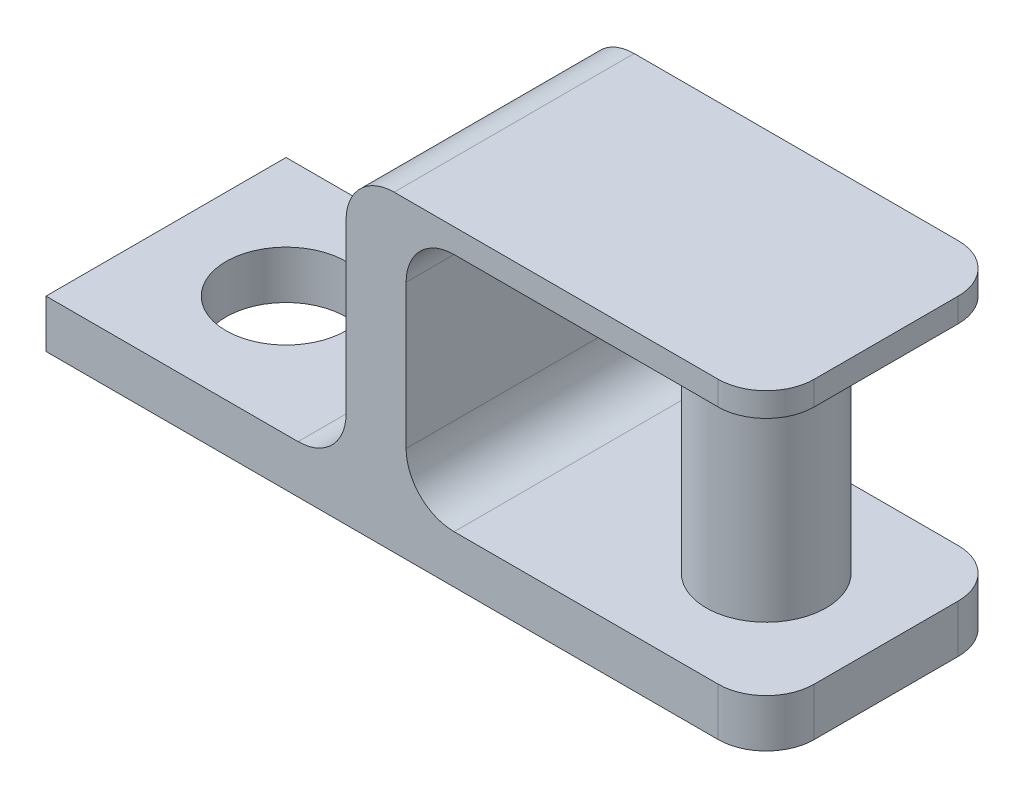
ISO-10303-21;
HEADER;
FILE_DESCRIPTION(('STEP AP214'),'2;1');
FILE_NAME('part.step','',(''),(''),'','','');
FILE_SCHEMA(('AUTOMOTIVE_DESIGN { 1 0 10303 214 1 1 1 1 }'));
ENDSEC;
DATA;
#1=APPLICATION_CONTEXT('core data for automotive mechanical design processes');
#2=APPLICATION_PROTOCOL_DEFINITION('international standard','automotive_design',2000,#1);
#3=PRODUCT_CONTEXT('',#1,'mechanical');
#4=PRODUCT('Part','Part','',(#3));
#5=PRODUCT_RELATED_PRODUCT_CATEGORY('part','',(#4));
#6=PRODUCT_DEFINITION_FORMATION('','',#4);
#7=PRODUCT_DEFINITION_CONTEXT('part definition',#1,'design');
#8=PRODUCT_DEFINITION('design','',#6,#7);
#9=PRODUCT_DEFINITION_SHAPE('','',#8);
#10=(LENGTH_UNIT() NAMED_UNIT(*) SI_UNIT(.MILLI.,.METRE.));
#11=(NAMED_UNIT(*) PLANE_ANGLE_UNIT() SI_UNIT($,.RADIAN.));
#12=(NAMED_UNIT(*) SI_UNIT($,.STERADIAN.) SOLID_ANGLE_UNIT());
#13=UNCERTAINTY_MEASURE_WITH_UNIT(LENGTH_MEASURE(1.E-05),#10,'distance_accuracy_value','');
#14=(GEOMETRIC_REPRESENTATION_CONTEXT(3) GLOBAL_UNCERTAINTY_ASSIGNED_CONTEXT((#13)) GLOBAL_UNIT_ASSIGNED_CONTEXT((#10,
#11,#12)) REPRESENTATION_CONTEXT('',''));
#15=CARTESIAN_POINT('',(0.,0.,0.));
#16=DIRECTION('',(0.,0.,1.));
#17=DIRECTION('',(1.,0.,0.));
#18=AXIS2_PLACEMENT_3D('',#15,#16,#17);
#19=CARTESIAN_POINT('',(28.,1.9999999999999,-2.));
#20=DIRECTION('',(0.,-1.,0.));
#21=DIRECTION('',(1.,0.,0.));
#22=AXIS2_PLACEMENT_3D('',#19,#20,#21);
#23=CYLINDRICAL_SURFACE('',#22,2.);
#24=CARTESIAN_POINT('',(28.,13.,-2.));
#25=DIRECTION('',(0.,-1.,0.));
#26=DIRECTION('',(1.,0.,0.));
#27=AXIS2_PLACEMENT_3D('',#24,#25,#26);
#28=CIRCLE('',#27,2.);
#29=CARTESIAN_POINT('',(28.,13.,0.));
#30=VERTEX_POINT('',#29);
#31=CARTESIAN_POINT('',(30.,13.,-2.));
#32=VERTEX_POINT('',#31);
#33=EDGE_CURVE('E239',#30,#32,#28,.F.);
#34=ORIENTED_EDGE('',*,*,#33,.F.);
#35=DIRECTION('',(0.,-1.,0.));
#36=VECTOR('',#35,1.);
#37=CARTESIAN_POINT('',(28.,1.9999999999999,0.));
#38=LINE('',#37,#36);
#39=CARTESIAN_POINT('',(28.,12.,0.));
#40=VERTEX_POINT('',#39);
#41=EDGE_CURVE('E147',#30,#40,#38,.T.);
#42=ORIENTED_EDGE('',*,*,#41,.T.);
#43=CARTESIAN_POINT('',(28.,12.,-2.));
#44=DIRECTION('',(0.,-1.,0.));
#45=DIRECTION('',(1.,0.,0.));
#46=AXIS2_PLACEMENT_3D('',#43,#44,#45);
#47=CIRCLE('',#46,2.);
#48=CARTESIAN_POINT('',(30.,12.,-2.));
#49=VERTEX_POINT('',#48);
#50=EDGE_CURVE('E151',#49,#40,#47,.T.);
#51=ORIENTED_EDGE('',*,*,#50,.F.);
#52=DIRECTION('',(0.,1.,0.));
#53=VECTOR('',#52,1.);
#54=CARTESIAN_POINT('',(30.,12.,-2.00000000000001));
#55=LINE('',#54,#53);
#56=EDGE_CURVE('E135',#32,#49,#55,.F.);
#57=ORIENTED_EDGE('',*,*,#56,.F.);
#58=EDGE_LOOP('',(#34,#42,#51,#57));
#59=FACE_BOUND('',#58,.T.);
#60=ADVANCED_FACE('F17',(#59),#23,.T.);
#61=CARTESIAN_POINT('',(30.,12.,-30.6700266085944));
#62=DIRECTION('',(1.,0.,0.));
#63=DIRECTION('',(0.,1.,0.));
#64=AXIS2_PLACEMENT_3D('',#61,#62,#63);
#65=PLANE('',#64);
#66=DIRECTION('',(0.,0.,-1.));
#67=VECTOR('',#66,1.);
#68=CARTESIAN_POINT('',(30.,12.,-30.6700266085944));
#69=LINE('',#68,#67);
#70=CARTESIAN_POINT('',(30.,12.,-8.));
#71=VERTEX_POINT('',#70);
#72=EDGE_CURVE('E139',#71,#49,#69,.F.);
#73=ORIENTED_EDGE('',*,*,#72,.F.);
#74=DIRECTION('',(0.,1.,0.));
#75=VECTOR('',#74,1.);
#76=CARTESIAN_POINT('',(30.,1.9999999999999,-8.00000000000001));
#77=LINE('',#76,#75);
#78=CARTESIAN_POINT('',(30.,13.,-8.00000000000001));
#79=VERTEX_POINT('',#78);
#80=EDGE_CURVE('E146',#79,#71,#77,.F.);
#81=ORIENTED_EDGE('',*,*,#80,.F.);
#82=DIRECTION('',(0.,0.,1.));
#83=VECTOR('',#82,1.);
#84=CARTESIAN_POINT('',(30.,13.,-30.6700266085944));
#85=LINE('',#84,#83);
#86=EDGE_CURVE('E142',#32,#79,#85,.F.);
#87=ORIENTED_EDGE('',*,*,#86,.F.);
#88=ORIENTED_EDGE('',*,*,#56,.T.);
#89=EDGE_LOOP('',(#73,#81,#87,#88));
#90=FACE_BOUND('',#89,.T.);
#91=ADVANCED_FACE('F137',(#90),#65,.T.);
#92=CARTESIAN_POINT('',(28.,1.9999999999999,-8.));
#93=DIRECTION('',(0.,1.,0.));
#94=DIRECTION('',(-1.,0.,0.));
#95=AXIS2_PLACEMENT_3D('',#92,#93,#94);
#96=CYLINDRICAL_SURFACE('',#95,2.);
#97=CARTESIAN_POINT('',(28.,12.,-8.));
#98=DIRECTION('',(0.,1.,0.));
#99=DIRECTION('',(-1.,0.,0.));
#100=AXIS2_PLACEMENT_3D('',#97,#98,#99);
#101=CIRCLE('',#100,2.);
#102=CARTESIAN_POINT('',(28.,12.,-10.));
#103=VERTEX_POINT('',#102);
#104=EDGE_CURVE('E161',#103,#71,#101,.F.);
#105=ORIENTED_EDGE('',*,*,#104,.F.);
#106=DIRECTION('',(0.,1.,0.));
#107=VECTOR('',#106,1.);
#108=CARTESIAN_POINT('',(28.,1.9999999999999,-10.));
#109=LINE('',#108,#107);
#110=CARTESIAN_POINT('',(28.,13.,-10.));
#111=VERTEX_POINT('',#110);
#112=EDGE_CURVE('E174',#103,#111,#109,.T.);
#113=ORIENTED_EDGE('',*,*,#112,.T.);
#114=CARTESIAN_POINT('',(28.,13.,-8.));
#115=DIRECTION('',(0.,1.,0.));
#116=DIRECTION('',(-1.,0.,0.));
#117=AXIS2_PLACEMENT_3D('',#114,#115,#116);
#118=CIRCLE('',#117,2.);
#119=EDGE_CURVE('E235',#79,#111,#118,.T.);
#120=ORIENTED_EDGE('',*,*,#119,.F.);
#121=ORIENTED_EDGE('',*,*,#80,.T.);
#122=EDGE_LOOP('',(#105,#113,#120,#121));
#123=FACE_BOUND('',#122,.T.);
#124=ADVANCED_FACE('F519',(#123),#96,.T.);
#125=CARTESIAN_POINT('',(25.,19.0710678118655,-5.));
#126=DIRECTION('',(0.,-1.,0.));
#127=DIRECTION('',(0.,0.,-1.));
#128=AXIS2_PLACEMENT_3D('',#125,#126,#127);
#129=CYLINDRICAL_SURFACE('',#128,2.5);
#130=CARTESIAN_POINT('',(25.,2.,-5.));
#131=DIRECTION('',(0.,-1.,0.));
#132=DIRECTION('',(0.,0.,-1.));
#133=AXIS2_PLACEMENT_3D('',#130,#131,#132);
#134=CIRCLE('',#133,2.5);
#135=CARTESIAN_POINT('',(25.,2.,-7.5));
#136=VERTEX_POINT('',#135);
#137=EDGE_CURVE('E231',#136,#136,#134,.F.);
#138=ORIENTED_EDGE('',*,*,#137,.T.);
#139=EDGE_LOOP('',(#138));
#140=FACE_BOUND('',#139,.T.);
#141=CARTESIAN_POINT('',(25.,12.,-5.));
#142=DIRECTION('',(0.,-1.,0.));
#143=DIRECTION('',(0.,0.,-1.));
#144=AXIS2_PLACEMENT_3D('',#141,#142,#143);
#145=CIRCLE('',#144,2.5);
#146=CARTESIAN_POINT('',(25.,12.,-7.5));
#147=VERTEX_POINT('',#146);
#148=EDGE_CURVE('E20',#147,#147,#145,.F.);
#149=ORIENTED_EDGE('',*,*,#148,.F.);
#150=EDGE_LOOP('',(#149));
#151=FACE_BOUND('',#150,.T.);
#152=ADVANCED_FACE('F511',(#140,#151),#129,.T.);
#153=CARTESIAN_POINT('',(17.,4.,0.));
#154=DIRECTION('',(0.,0.,1.));
#155=DIRECTION('',(1.,0.,0.));
#156=AXIS2_PLACEMENT_3D('',#153,#154,#155);
#157=CYLINDRICAL_SURFACE('',#156,2.);
#158=DIRECTION('',(0.,0.,-1.));
#159=VECTOR('',#158,1.);
#160=CARTESIAN_POINT('',(15.,4.,-30.6700266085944));
#161=LINE('',#160,#159);
#162=CARTESIAN_POINT('',(15.,4.,0.));
#163=VERTEX_POINT('',#162);
#164=CARTESIAN_POINT('',(15.,4.,-10.));
#165=VERTEX_POINT('',#164);
#166=EDGE_CURVE('E171',#163,#165,#161,.T.);
#167=ORIENTED_EDGE('',*,*,#166,.F.);
#168=CARTESIAN_POINT('',(17.,4.,0.));
#169=DIRECTION('',(0.,0.,1.));
#170=DIRECTION('',(1.,0.,0.));
#171=AXIS2_PLACEMENT_3D('',#168,#169,#170);
#172=CIRCLE('',#171,2.);
#173=CARTESIAN_POINT('',(17.,2.,0.));
#174=VERTEX_POINT('',#173);
#175=EDGE_CURVE('E205',#163,#174,#172,.T.);
#176=ORIENTED_EDGE('',*,*,#175,.T.);
#177=DIRECTION('',(0.,0.,-1.));
#178=VECTOR('',#177,1.);
#179=CARTESIAN_POINT('',(17.,2.,0.));
#180=LINE('',#179,#178);
#181=CARTESIAN_POINT('',(17.,2.,-10.));
#182=VERTEX_POINT('',#181);
#183=EDGE_CURVE('E230',#174,#182,#180,.T.);
#184=ORIENTED_EDGE('',*,*,#183,.T.);
#185=CARTESIAN_POINT('',(17.,4.,-10.));
#186=DIRECTION('',(0.,0.,1.));
#187=DIRECTION('',(1.,0.,0.));
#188=AXIS2_PLACEMENT_3D('',#185,#186,#187);
#189=CIRCLE('',#188,2.);
#190=EDGE_CURVE('E202',#182,#165,#189,.F.);
#191=ORIENTED_EDGE('',*,*,#190,.T.);
#192=EDGE_LOOP('',(#167,#176,#184,#191));
#193=FACE_BOUND('',#192,.T.);
#194=ADVANCED_FACE('F318',(#193),#157,.F.);
#195=CARTESIAN_POINT('',(15.,2.,-30.6700266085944));
#196=DIRECTION('',(1.,0.,0.));
#197=DIRECTION('',(0.,0.,-1.));
#198=AXIS2_PLACEMENT_3D('',#195,#196,#197);
#199=PLANE('',#198);
#200=DIRECTION('',(0.,1.,0.));
#201=VECTOR('',#200,1.);
#202=CARTESIAN_POINT('',(15.,2.,0.));
#203=LINE('',#202,#201);
#204=CARTESIAN_POINT('',(15.,10.,0.));
#205=VERTEX_POINT('',#204);
#206=EDGE_CURVE('E208',#205,#163,#203,.F.);
#207=ORIENTED_EDGE('',*,*,#206,.T.);
#208=ORIENTED_EDGE('',*,*,#166,.T.);
#209=DIRECTION('',(0.,1.,0.));
#210=VECTOR('',#209,1.);
#211=CARTESIAN_POINT('',(15.,2.,-10.));
#212=LINE('',#211,#210);
#213=CARTESIAN_POINT('',(15.,10.,-10.));
#214=VERTEX_POINT('',#213);
#215=EDGE_CURVE('E201',#165,#214,#212,.T.);
#216=ORIENTED_EDGE('',*,*,#215,.T.);
#217=DIRECTION('',(0.,0.,-1.));
#218=VECTOR('',#217,1.);
#219=CARTESIAN_POINT('',(15.,10.,-30.6700266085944));
#220=LINE('',#219,#218);
#221=EDGE_CURVE('E164',#214,#205,#220,.F.);
#222=ORIENTED_EDGE('',*,*,#221,.T.);
#223=EDGE_LOOP('',(#207,#208,#216,#222));
#224=FACE_BOUND('',#223,.T.);
#225=ADVANCED_FACE('F315',(#224),#199,.T.);
#226=CARTESIAN_POINT('',(17.,10.,-30.6700266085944));
#227=DIRECTION('',(0.,0.,-1.));
#228=DIRECTION('',(-1.,0.,0.));
#229=AXIS2_PLACEMENT_3D('',#226,#227,#228);
#230=CYLINDRICAL_SURFACE('',#229,2.);
#231=DIRECTION('',(0.,0.,-1.));
#232=VECTOR('',#231,1.);
#233=CARTESIAN_POINT('',(17.,12.,-30.6700266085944));
#234=LINE('',#233,#232);
#235=CARTESIAN_POINT('',(17.,12.,0.));
#236=VERTEX_POINT('',#235);
#237=CARTESIAN_POINT('',(17.,12.,-10.));
#238=VERTEX_POINT('',#237);
#239=EDGE_CURVE('E155',#236,#238,#234,.T.);
#240=ORIENTED_EDGE('',*,*,#239,.F.);
#241=CARTESIAN_POINT('',(17.,10.,0.));
#242=DIRECTION('',(0.,0.,-1.));
#243=DIRECTION('',(-1.,0.,0.));
#244=AXIS2_PLACEMENT_3D('',#241,#242,#243);
#245=CIRCLE('',#244,2.);
#246=EDGE_CURVE('E209',#236,#205,#245,.F.);
#247=ORIENTED_EDGE('',*,*,#246,.T.);
#248=ORIENTED_EDGE('',*,*,#221,.F.);
#249=CARTESIAN_POINT('',(17.,10.,-10.));
#250=DIRECTION('',(0.,0.,-1.));
#251=DIRECTION('',(-1.,0.,0.));
#252=AXIS2_PLACEMENT_3D('',#249,#250,#251);
#253=CIRCLE('',#252,2.);
#254=EDGE_CURVE('E198',#214,#238,#253,.T.);
#255=ORIENTED_EDGE('',*,*,#254,.T.);
#256=EDGE_LOOP('',(#240,#247,#248,#255));
#257=FACE_BOUND('',#256,.T.);
#258=ADVANCED_FACE('F313',(#257),#230,.F.);
#259=CARTESIAN_POINT('',(15.,12.,-30.6700266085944));
#260=DIRECTION('',(0.,-1.,0.));
#261=DIRECTION('',(0.,0.,-1.));
#262=AXIS2_PLACEMENT_3D('',#259,#260,#261);
#263=PLANE('',#262);
#264=DIRECTION('',(1.,0.,0.));
#265=VECTOR('',#264,1.);
#266=CARTESIAN_POINT('',(0.,12.,-10.));
#267=LINE('',#266,#265);
#268=EDGE_CURVE('E200',#238,#103,#267,.T.);
#269=ORIENTED_EDGE('',*,*,#268,.T.);
#270=ORIENTED_EDGE('',*,*,#104,.T.);
#271=ORIENTED_EDGE('',*,*,#72,.T.);
#272=ORIENTED_EDGE('',*,*,#50,.T.);
#273=DIRECTION('',(-1.,0.,0.));
#274=VECTOR('',#273,1.);
#275=CARTESIAN_POINT('',(0.,12.,0.));
#276=LINE('',#275,#274);
#277=EDGE_CURVE('E212',#40,#236,#276,.T.);
#278=ORIENTED_EDGE('',*,*,#277,.T.);
#279=ORIENTED_EDGE('',*,*,#239,.T.);
#280=EDGE_LOOP('',(#269,#270,#271,#272,#278,#279));
#281=FACE_BOUND('',#280,.T.);
#282=ORIENTED_EDGE('',*,*,#148,.T.);
#283=EDGE_LOOP('',(#282));
#284=FACE_BOUND('',#283,.T.);
#285=ADVANCED_FACE('F158',(#281,#284),#263,.T.);
#286=CARTESIAN_POINT('',(30.,13.,-30.6700266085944));
#287=DIRECTION('',(0.,1.,0.));
#288=DIRECTION('',(-1.,0.,0.));
#289=AXIS2_PLACEMENT_3D('',#286,#287,#288);
#290=PLANE('',#289);
#291=DIRECTION('',(1.,0.,0.));
#292=VECTOR('',#291,1.);
#293=CARTESIAN_POINT('',(0.,13.,-10.));
#294=LINE('',#293,#292);
#295=CARTESIAN_POINT('',(14.5,13.,-10.));
#296=VERTEX_POINT('',#295);
#297=EDGE_CURVE('E197',#111,#296,#294,.F.);
#298=ORIENTED_EDGE('',*,*,#297,.T.);
#299=DIRECTION('',(0.,0.,1.));
#300=VECTOR('',#299,1.);
#301=CARTESIAN_POINT('',(14.5,13.,-30.6700266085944));
#302=LINE('',#301,#300);
#303=CARTESIAN_POINT('',(14.5,13.,0.));
#304=VERTEX_POINT('',#303);
#305=EDGE_CURVE('E238',#304,#296,#302,.F.);
#306=ORIENTED_EDGE('',*,*,#305,.F.);
#307=DIRECTION('',(-1.,0.,0.));
#308=VECTOR('',#307,1.);
#309=CARTESIAN_POINT('',(0.,13.,0.));
#310=LINE('',#309,#308);
#311=EDGE_CURVE('E216',#304,#30,#310,.F.);
#312=ORIENTED_EDGE('',*,*,#311,.T.);
#313=ORIENTED_EDGE('',*,*,#33,.T.);
#314=ORIENTED_EDGE('',*,*,#86,.T.);
#315=ORIENTED_EDGE('',*,*,#119,.T.);
#316=EDGE_LOOP('',(#298,#306,#312,#313,#314,#315));
#317=FACE_BOUND('',#316,.T.);
#318=ADVANCED_FACE('F243',(#317),#290,.T.);
#319=CARTESIAN_POINT('',(14.5,11.,-30.6700266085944));
#320=DIRECTION('',(0.,0.,1.));
#321=DIRECTION('',(1.,0.,0.));
#322=AXIS2_PLACEMENT_3D('',#319,#320,#321);
#323=CYLINDRICAL_SURFACE('',#322,2.);
#324=CARTESIAN_POINT('',(14.5,11.,0.));
#325=DIRECTION('',(0.,0.,1.));
#326=DIRECTION('',(1.,0.,0.));
#327=AXIS2_PLACEMENT_3D('',#324,#325,#326);
#328=CIRCLE('',#327,2.);
#329=CARTESIAN_POINT('',(12.5,11.,0.));
#330=VERTEX_POINT('',#329);
#331=EDGE_CURVE('E213',#330,#304,#328,.F.);
#332=ORIENTED_EDGE('',*,*,#331,.T.);
#333=ORIENTED_EDGE('',*,*,#305,.T.);
#334=CARTESIAN_POINT('',(14.5,11.,-10.));
#335=DIRECTION('',(0.,0.,1.));
#336=DIRECTION('',(1.,0.,0.));
#337=AXIS2_PLACEMENT_3D('',#334,#335,#336);
#338=CIRCLE('',#337,2.);
#339=CARTESIAN_POINT('',(12.5,11.,-10.));
#340=VERTEX_POINT('',#339);
#341=EDGE_CURVE('E195',#296,#340,#338,.T.);
#342=ORIENTED_EDGE('',*,*,#341,.T.);
#343=DIRECTION('',(0.,0.,1.));
#344=VECTOR('',#343,1.);
#345=CARTESIAN_POINT('',(12.5,11.,-30.6700266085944));
#346=LINE('',#345,#344);
#347=EDGE_CURVE('E296',#330,#340,#346,.F.);
#348=ORIENTED_EDGE('',*,*,#347,.F.);
#349=EDGE_LOOP('',(#332,#333,#342,#348));
#350=FACE_BOUND('',#349,.T.);
#351=ADVANCED_FACE('F299',(#350),#323,.T.);
#352=CARTESIAN_POINT('',(12.5,13.,-30.6700266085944));
#353=DIRECTION('',(-1.,0.,0.));
#354=DIRECTION('',(0.,-1.,0.));
#355=AXIS2_PLACEMENT_3D('',#352,#353,#354);
#356=PLANE('',#355);
#357=DIRECTION('',(0.,1.,0.));
#358=VECTOR('',#357,1.);
#359=CARTESIAN_POINT('',(12.5,2.,0.));
#360=LINE('',#359,#358);
#361=CARTESIAN_POINT('',(12.5,4.,0.));
#362=VERTEX_POINT('',#361);
#363=EDGE_CURVE('E217',#362,#330,#360,.T.);
#364=ORIENTED_EDGE('',*,*,#363,.T.);
#365=ORIENTED_EDGE('',*,*,#347,.T.);
#366=DIRECTION('',(0.,1.,0.));
#367=VECTOR('',#366,1.);
#368=CARTESIAN_POINT('',(12.5,2.,-10.));
#369=LINE('',#368,#367);
#370=CARTESIAN_POINT('',(12.5,4.,-10.));
#371=VERTEX_POINT('',#370);
#372=EDGE_CURVE('E194',#340,#371,#369,.F.);
#373=ORIENTED_EDGE('',*,*,#372,.T.);
#374=DIRECTION('',(0.,0.,1.));
#375=VECTOR('',#374,1.);
#376=CARTESIAN_POINT('',(12.5,4.,-30.6700266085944));
#377=LINE('',#376,#375);
#378=EDGE_CURVE('E294',#371,#362,#377,.T.);
#379=ORIENTED_EDGE('',*,*,#378,.T.);
#380=EDGE_LOOP('',(#364,#365,#373,#379));
#381=FACE_BOUND('',#380,.T.);
#382=ADVANCED_FACE('F358',(#381),#356,.T.);
#383=CARTESIAN_POINT('',(10.5,4.,-30.6700266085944));
#384=DIRECTION('',(0.,0.,1.));
#385=DIRECTION('',(1.,0.,0.));
#386=AXIS2_PLACEMENT_3D('',#383,#384,#385);
#387=CYLINDRICAL_SURFACE('',#386,2.);
#388=DIRECTION('',(0.,0.,-1.));
#389=VECTOR('',#388,1.);
#390=CARTESIAN_POINT('',(10.5,2.,0.));
#391=LINE('',#390,#389);
#392=CARTESIAN_POINT('',(10.5,2.,-10.));
#393=VERTEX_POINT('',#392);
#394=CARTESIAN_POINT('',(10.5,2.,0.));
#395=VERTEX_POINT('',#394);
#396=EDGE_CURVE('E234',#393,#395,#391,.F.);
#397=ORIENTED_EDGE('',*,*,#396,.T.);
#398=CARTESIAN_POINT('',(10.5,4.,0.));
#399=DIRECTION('',(0.,0.,1.));
#400=DIRECTION('',(1.,0.,0.));
#401=AXIS2_PLACEMENT_3D('',#398,#399,#400);
#402=CIRCLE('',#401,2.);
#403=EDGE_CURVE('E218',#395,#362,#402,.T.);
#404=ORIENTED_EDGE('',*,*,#403,.T.);
#405=ORIENTED_EDGE('',*,*,#378,.F.);
#406=CARTESIAN_POINT('',(10.5,4.,-10.));
#407=DIRECTION('',(0.,0.,1.));
#408=DIRECTION('',(1.,0.,0.));
#409=AXIS2_PLACEMENT_3D('',#406,#407,#408);
#410=CIRCLE('',#409,2.);
#411=EDGE_CURVE('E191',#371,#393,#410,.F.);
#412=ORIENTED_EDGE('',*,*,#411,.T.);
#413=EDGE_LOOP('',(#397,#404,#405,#412));
#414=FACE_BOUND('',#413,.T.);
#415=ADVANCED_FACE('F356',(#414),#387,.F.);
#416=CARTESIAN_POINT('',(0.,2.,0.));
#417=DIRECTION('',(0.,-1.,0.));
#418=DIRECTION('',(0.,0.,-1.));
#419=AXIS2_PLACEMENT_3D('',#416,#417,#418);
#420=PLANE('',#419);
#421=ORIENTED_EDGE('',*,*,#396,.F.);
#422=DIRECTION('',(1.,0.,0.));
#423=VECTOR('',#422,1.);
#424=CARTESIAN_POINT('',(0.,2.,-10.));
#425=LINE('',#424,#423);
#426=CARTESIAN_POINT('',(0.,2.,-10.));
#427=VERTEX_POINT('',#426);
#428=EDGE_CURVE('E193',#393,#427,#425,.F.);
#429=ORIENTED_EDGE('',*,*,#428,.T.);
#430=DIRECTION('',(0.,0.,-1.));
#431=VECTOR('',#430,1.);
#432=CARTESIAN_POINT('',(0.,2.,0.));
#433=LINE('',#432,#431);
#434=CARTESIAN_POINT('',(0.,2.,0.));
#435=VERTEX_POINT('',#434);
#436=EDGE_CURVE('E269',#427,#435,#433,.F.);
#437=ORIENTED_EDGE('',*,*,#436,.T.);
#438=DIRECTION('',(-1.,0.,0.));
#439=VECTOR('',#438,1.);
#440=CARTESIAN_POINT('',(0.,2.,0.));
#441=LINE('',#440,#439);
#442=EDGE_CURVE('E221',#435,#395,#441,.F.);
#443=ORIENTED_EDGE('',*,*,#442,.T.);
#444=EDGE_LOOP('',(#421,#429,#437,#443));
#445=FACE_BOUND('',#444,.T.);
#446=CARTESIAN_POINT('',(5.,2.,-5.));
#447=DIRECTION('',(0.,1.,0.));
#448=DIRECTION('',(0.,0.,1.));
#449=AXIS2_PLACEMENT_3D('',#446,#447,#448);
#450=CIRCLE('',#449,2.5);
#451=CARTESIAN_POINT('',(5.,2.,-2.5));
#452=VERTEX_POINT('',#451);
#453=EDGE_CURVE('E227',#452,#452,#450,.F.);
#454=ORIENTED_EDGE('',*,*,#453,.T.);
#455=EDGE_LOOP('',(#454));
#456=FACE_BOUND('',#455,.T.);
#457=ADVANCED_FACE('F337',(#445,#456),#420,.F.);
#458=CARTESIAN_POINT('',(0.,2.,0.));
#459=DIRECTION('',(0.,-1.,0.));
#460=DIRECTION('',(0.,0.,-1.));
#461=AXIS2_PLACEMENT_3D('',#458,#459,#460);
#462=PLANE('',#461);
#463=CARTESIAN_POINT('',(28.,2.,-2.));
#464=DIRECTION('',(0.,-1.,0.));
#465=DIRECTION('',(0.,0.,-1.));
#466=AXIS2_PLACEMENT_3D('',#463,#464,#465);
#467=CIRCLE('',#466,2.);
#468=CARTESIAN_POINT('',(30.,2.,-2.));
#469=VERTEX_POINT('',#468);
#470=CARTESIAN_POINT('',(28.,2.,0.));
#471=VERTEX_POINT('',#470);
#472=EDGE_CURVE('E222',#469,#471,#467,.T.);
#473=ORIENTED_EDGE('',*,*,#472,.F.);
#474=DIRECTION('',(0.,0.,1.));
#475=VECTOR('',#474,1.);
#476=CARTESIAN_POINT('',(30.,2.,0.));
#477=LINE('',#476,#475);
#478=CARTESIAN_POINT('',(30.,2.,-8.));
#479=VERTEX_POINT('',#478);
#480=EDGE_CURVE('E226',#469,#479,#477,.F.);
#481=ORIENTED_EDGE('',*,*,#480,.T.);
#482=CARTESIAN_POINT('',(28.,2.,-8.));
#483=DIRECTION('',(0.,-1.,0.));
#484=DIRECTION('',(0.,0.,-1.));
#485=AXIS2_PLACEMENT_3D('',#482,#483,#484);
#486=CIRCLE('',#485,2.);
#487=CARTESIAN_POINT('',(28.,2.,-10.));
#488=VERTEX_POINT('',#487);
#489=EDGE_CURVE('E186',#488,#479,#486,.T.);
#490=ORIENTED_EDGE('',*,*,#489,.F.);
#491=DIRECTION('',(1.,0.,0.));
#492=VECTOR('',#491,1.);
#493=CARTESIAN_POINT('',(0.,2.,-10.));
#494=LINE('',#493,#492);
#495=EDGE_CURVE('E190',#488,#182,#494,.F.);
#496=ORIENTED_EDGE('',*,*,#495,.T.);
#497=ORIENTED_EDGE('',*,*,#183,.F.);
#498=DIRECTION('',(-1.,0.,0.));
#499=VECTOR('',#498,1.);
#500=CARTESIAN_POINT('',(0.,2.,0.));
#501=LINE('',#500,#499);
#502=EDGE_CURVE('E207',#174,#471,#501,.F.);
#503=ORIENTED_EDGE('',*,*,#502,.T.);
#504=EDGE_LOOP('',(#473,#481,#490,#496,#497,#503));
#505=FACE_BOUND('',#504,.T.);
#506=ORIENTED_EDGE('',*,*,#137,.F.);
#507=EDGE_LOOP('',(#506));
#508=FACE_BOUND('',#507,.T.);
#509=ADVANCED_FACE('F392',(#505,#508),#462,.F.);
#510=CARTESIAN_POINT('',(5.,-8.,-5.));
#511=DIRECTION('',(0.,1.,0.));
#512=DIRECTION('',(0.,0.,1.));
#513=AXIS2_PLACEMENT_3D('',#510,#511,#512);
#514=CYLINDRICAL_SURFACE('',#513,2.5);
#515=CARTESIAN_POINT('',(5.,0.,-5.));
#516=DIRECTION('',(0.,1.,0.));
#517=DIRECTION('',(0.,0.,1.));
#518=AXIS2_PLACEMENT_3D('',#515,#516,#517);
#519=CIRCLE('',#518,2.5);
#520=CARTESIAN_POINT('',(5.,0.,-2.5));
#521=VERTEX_POINT('',#520);
#522=EDGE_CURVE('E183',#521,#521,#519,.T.);
#523=ORIENTED_EDGE('',*,*,#522,.F.);
#524=EDGE_LOOP('',(#523));
#525=FACE_BOUND('',#524,.T.);
#526=ORIENTED_EDGE('',*,*,#453,.F.);
#527=EDGE_LOOP('',(#526));
#528=FACE_BOUND('',#527,.T.);
#529=ADVANCED_FACE('F388',(#525,#528),#514,.F.);
#530=CARTESIAN_POINT('',(30.,2.,0.));
#531=DIRECTION('',(-1.,0.,0.));
#532=DIRECTION('',(0.,0.,1.));
#533=AXIS2_PLACEMENT_3D('',#530,#531,#532);
#534=PLANE('',#533);
#535=DIRECTION('',(0.,-1.,0.));
#536=VECTOR('',#535,1.);
#537=CARTESIAN_POINT('',(30.,2.,-2.));
#538=LINE('',#537,#536);
#539=CARTESIAN_POINT('',(30.,0.,-2.));
#540=VERTEX_POINT('',#539);
#541=EDGE_CURVE('E225',#540,#469,#538,.F.);
#542=ORIENTED_EDGE('',*,*,#541,.F.);
#543=DIRECTION('',(0.,0.,-1.));
#544=VECTOR('',#543,1.);
#545=CARTESIAN_POINT('',(30.,0.,0.));
#546=LINE('',#545,#544);
#547=CARTESIAN_POINT('',(30.,0.,-8.));
#548=VERTEX_POINT('',#547);
#549=EDGE_CURVE('E182',#548,#540,#546,.F.);
#550=ORIENTED_EDGE('',*,*,#549,.F.);
#551=DIRECTION('',(0.,-1.,0.));
#552=VECTOR('',#551,1.);
#553=CARTESIAN_POINT('',(30.,2.,-8.));
#554=LINE('',#553,#552);
#555=EDGE_CURVE('E189',#479,#548,#554,.T.);
#556=ORIENTED_EDGE('',*,*,#555,.F.);
#557=ORIENTED_EDGE('',*,*,#480,.F.);
#558=EDGE_LOOP('',(#542,#550,#556,#557));
#559=FACE_BOUND('',#558,.T.);
#560=ADVANCED_FACE('F384',(#559),#534,.F.);
#561=CARTESIAN_POINT('',(28.,2.,-2.));
#562=DIRECTION('',(0.,-1.,0.));
#563=DIRECTION('',(0.,0.,-1.));
#564=AXIS2_PLACEMENT_3D('',#561,#562,#563);
#565=CYLINDRICAL_SURFACE('',#564,2.);
#566=CARTESIAN_POINT('',(28.,0.,-2.));
#567=DIRECTION('',(0.,-1.,0.));
#568=DIRECTION('',(0.,0.,-1.));
#569=AXIS2_PLACEMENT_3D('',#566,#567,#568);
#570=CIRCLE('',#569,2.);
#571=CARTESIAN_POINT('',(28.,0.,0.));
#572=VERTEX_POINT('',#571);
#573=EDGE_CURVE('E178',#540,#572,#570,.T.);
#574=ORIENTED_EDGE('',*,*,#573,.F.);
#575=ORIENTED_EDGE('',*,*,#541,.T.);
#576=ORIENTED_EDGE('',*,*,#472,.T.);
#577=DIRECTION('',(0.,1.,0.));
#578=VECTOR('',#577,1.);
#579=CARTESIAN_POINT('',(28.,2.,0.));
#580=LINE('',#579,#578);
#581=EDGE_CURVE('E273',#471,#572,#580,.F.);
#582=ORIENTED_EDGE('',*,*,#581,.T.);
#583=EDGE_LOOP('',(#574,#575,#576,#582));
#584=FACE_BOUND('',#583,.T.);
#585=ADVANCED_FACE('F381',(#584),#565,.T.);
#586=CARTESIAN_POINT('',(0.,2.,0.));
#587=DIRECTION('',(0.,0.,-1.));
#588=DIRECTION('',(-1.,0.,0.));
#589=AXIS2_PLACEMENT_3D('',#586,#587,#588);
#590=PLANE('',#589);
#591=ORIENTED_EDGE('',*,*,#581,.F.);
#592=ORIENTED_EDGE('',*,*,#502,.F.);
#593=ORIENTED_EDGE('',*,*,#175,.F.);
#594=ORIENTED_EDGE('',*,*,#206,.F.);
#595=ORIENTED_EDGE('',*,*,#246,.F.);
#596=ORIENTED_EDGE('',*,*,#277,.F.);
#597=ORIENTED_EDGE('',*,*,#41,.F.);
#598=ORIENTED_EDGE('',*,*,#311,.F.);
#599=ORIENTED_EDGE('',*,*,#331,.F.);
#600=ORIENTED_EDGE('',*,*,#363,.F.);
#601=ORIENTED_EDGE('',*,*,#403,.F.);
#602=ORIENTED_EDGE('',*,*,#442,.F.);
#603=DIRECTION('',(0.,1.,0.));
#604=VECTOR('',#603,1.);
#605=CARTESIAN_POINT('',(0.,2.,0.));
#606=LINE('',#605,#604);
#607=CARTESIAN_POINT('',(0.,0.,0.));
#608=VERTEX_POINT('',#607);
#609=EDGE_CURVE('E204',#435,#608,#606,.F.);
#610=ORIENTED_EDGE('',*,*,#609,.T.);
#611=DIRECTION('',(1.,0.,0.));
#612=VECTOR('',#611,1.);
#613=CARTESIAN_POINT('',(0.,0.,0.));
#614=LINE('',#613,#612);
#615=EDGE_CURVE('E181',#572,#608,#614,.F.);
#616=ORIENTED_EDGE('',*,*,#615,.F.);
#617=EDGE_LOOP('',(#591,#592,#593,#594,#595,#596,#597,#598,#599,#600,#601,#602,#610,#616));
#618=FACE_BOUND('',#617,.T.);
#619=ADVANCED_FACE('F304',(#618),#590,.F.);
#620=CARTESIAN_POINT('',(0.,2.,0.));
#621=DIRECTION('',(1.,0.,0.));
#622=DIRECTION('',(0.,0.,-1.));
#623=AXIS2_PLACEMENT_3D('',#620,#621,#622);
#624=PLANE('',#623);
#625=ORIENTED_EDGE('',*,*,#609,.F.);
#626=ORIENTED_EDGE('',*,*,#436,.F.);
#627=DIRECTION('',(0.,1.,0.));
#628=VECTOR('',#627,1.);
#629=CARTESIAN_POINT('',(0.,2.,-10.));
#630=LINE('',#629,#628);
#631=CARTESIAN_POINT('',(0.,0.,-10.));
#632=VERTEX_POINT('',#631);
#633=EDGE_CURVE('E258',#427,#632,#630,.F.);
#634=ORIENTED_EDGE('',*,*,#633,.T.);
#635=DIRECTION('',(0.,0.,-1.));
#636=VECTOR('',#635,1.);
#637=CARTESIAN_POINT('',(0.,0.,0.));
#638=LINE('',#637,#636);
#639=EDGE_CURVE('E262',#608,#632,#638,.T.);
#640=ORIENTED_EDGE('',*,*,#639,.F.);
#641=EDGE_LOOP('',(#625,#626,#634,#640));
#642=FACE_BOUND('',#641,.T.);
#643=ADVANCED_FACE('F344',(#642),#624,.F.);
#644=CARTESIAN_POINT('',(0.,2.,-10.));
#645=DIRECTION('',(0.,0.,1.));
#646=DIRECTION('',(1.,0.,0.));
#647=AXIS2_PLACEMENT_3D('',#644,#645,#646);
#648=PLANE('',#647);
#649=DIRECTION('',(0.,-1.,0.));
#650=VECTOR('',#649,1.);
#651=CARTESIAN_POINT('',(28.,2.,-10.));
#652=LINE('',#651,#650);
#653=CARTESIAN_POINT('',(28.,0.,-10.));
#654=VERTEX_POINT('',#653);
#655=EDGE_CURVE('E35',#654,#488,#652,.F.);
#656=ORIENTED_EDGE('',*,*,#655,.F.);
#657=DIRECTION('',(1.,0.,0.));
#658=VECTOR('',#657,1.);
#659=CARTESIAN_POINT('',(0.,0.,-10.));
#660=LINE('',#659,#658);
#661=EDGE_CURVE('E26',#632,#654,#660,.T.);
#662=ORIENTED_EDGE('',*,*,#661,.F.);
#663=ORIENTED_EDGE('',*,*,#633,.F.);
#664=ORIENTED_EDGE('',*,*,#428,.F.);
#665=ORIENTED_EDGE('',*,*,#411,.F.);
#666=ORIENTED_EDGE('',*,*,#372,.F.);
#667=ORIENTED_EDGE('',*,*,#341,.F.);
#668=ORIENTED_EDGE('',*,*,#297,.F.);
#669=ORIENTED_EDGE('',*,*,#112,.F.);
#670=ORIENTED_EDGE('',*,*,#268,.F.);
#671=ORIENTED_EDGE('',*,*,#254,.F.);
#672=ORIENTED_EDGE('',*,*,#215,.F.);
#673=ORIENTED_EDGE('',*,*,#190,.F.);
#674=ORIENTED_EDGE('',*,*,#495,.F.);
#675=EDGE_LOOP('',(#656,#662,#663,#664,#665,#666,#667,#668,#669,#670,#671,#672,#673,#674));
#676=FACE_BOUND('',#675,.T.);
#677=ADVANCED_FACE('F249',(#676),#648,.F.);
#678=CARTESIAN_POINT('',(28.,2.,-8.));
#679=DIRECTION('',(0.,-1.,0.));
#680=DIRECTION('',(0.,0.,-1.));
#681=AXIS2_PLACEMENT_3D('',#678,#679,#680);
#682=CYLINDRICAL_SURFACE('',#681,2.);
#683=CARTESIAN_POINT('',(28.,0.,-8.));
#684=DIRECTION('',(0.,-1.,0.));
#685=DIRECTION('',(0.,0.,-1.));
#686=AXIS2_PLACEMENT_3D('',#683,#684,#685);
#687=CIRCLE('',#686,2.);
#688=EDGE_CURVE('E11',#654,#548,#687,.T.);
#689=ORIENTED_EDGE('',*,*,#688,.F.);
#690=ORIENTED_EDGE('',*,*,#655,.T.);
#691=ORIENTED_EDGE('',*,*,#489,.T.);
#692=ORIENTED_EDGE('',*,*,#555,.T.);
#693=EDGE_LOOP('',(#689,#690,#691,#692));
#694=FACE_BOUND('',#693,.T.);
#695=ADVANCED_FACE('F324',(#694),#682,.T.);
#696=CARTESIAN_POINT('',(0.,0.,0.));
#697=DIRECTION('',(0.,-1.,0.));
#698=DIRECTION('',(0.,0.,-1.));
#699=AXIS2_PLACEMENT_3D('',#696,#697,#698);
#700=PLANE('',#699);
#701=ORIENTED_EDGE('',*,*,#661,.T.);
#702=ORIENTED_EDGE('',*,*,#688,.T.);
#703=ORIENTED_EDGE('',*,*,#549,.T.);
#704=ORIENTED_EDGE('',*,*,#573,.T.);
#705=ORIENTED_EDGE('',*,*,#615,.T.);
#706=ORIENTED_EDGE('',*,*,#639,.T.);
#707=EDGE_LOOP('',(#701,#702,#703,#704,#705,#706));
#708=FACE_BOUND('',#707,.T.);
#709=ORIENTED_EDGE('',*,*,#522,.T.);
#710=EDGE_LOOP('',(#709));
#711=FACE_BOUND('',#710,.T.);
#712=ADVANCED_FACE('F349',(#708,#711),#700,.T.);
#713=CLOSED_SHELL('',(#60,#91,#124,#152,#194,#225,#258,#285,#318,#351,#382,#415,#457,#509,#529,
#560,#585,#619,#643,#677,#695,#712));
#714=MANIFOLD_SOLID_BREP('B1',#713);
#715=ADVANCED_BREP_SHAPE_REPRESENTATION('',(#18,#714),#14);
#716=SHAPE_DEFINITION_REPRESENTATION(#9,#715);
ENDSEC;
END-ISO-10303-21;
